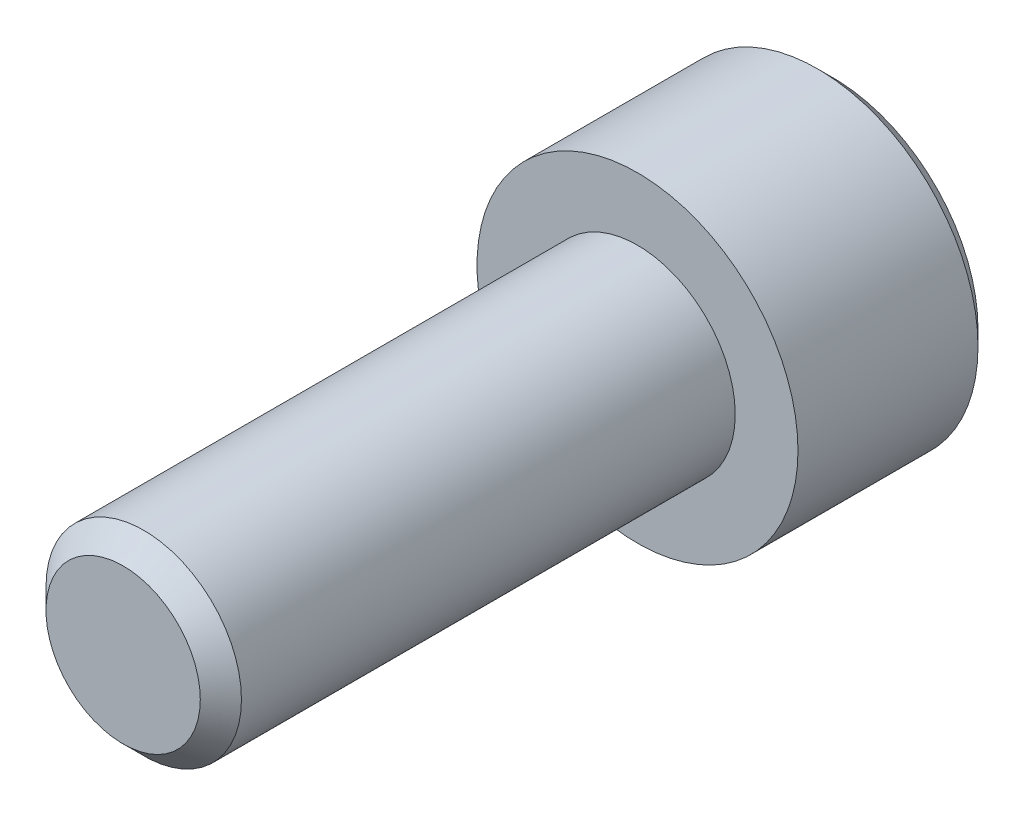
ISO-10303-21;
HEADER;
FILE_DESCRIPTION(('STEP AP214'),'2;1');
FILE_NAME('part.step','',(''),(''),'','','');
FILE_SCHEMA(('AUTOMOTIVE_DESIGN { 1 0 10303 214 1 1 1 1 }'));
ENDSEC;
DATA;
#1=APPLICATION_CONTEXT('core data for automotive mechanical design processes');
#2=APPLICATION_PROTOCOL_DEFINITION('international standard','automotive_design',2000,#1);
#3=PRODUCT_CONTEXT('',#1,'mechanical');
#4=PRODUCT('Part','Part','',(#3));
#5=PRODUCT_RELATED_PRODUCT_CATEGORY('part','',(#4));
#6=PRODUCT_DEFINITION_FORMATION('','',#4);
#7=PRODUCT_DEFINITION_CONTEXT('part definition',#1,'design');
#8=PRODUCT_DEFINITION('design','',#6,#7);
#9=PRODUCT_DEFINITION_SHAPE('','',#8);
#10=(LENGTH_UNIT() NAMED_UNIT(*) SI_UNIT(.MILLI.,.METRE.));
#11=(NAMED_UNIT(*) PLANE_ANGLE_UNIT() SI_UNIT($,.RADIAN.));
#12=(NAMED_UNIT(*) SI_UNIT($,.STERADIAN.) SOLID_ANGLE_UNIT());
#13=UNCERTAINTY_MEASURE_WITH_UNIT(LENGTH_MEASURE(1.E-05),#10,'distance_accuracy_value','');
#14=(GEOMETRIC_REPRESENTATION_CONTEXT(3) GLOBAL_UNCERTAINTY_ASSIGNED_CONTEXT((#13)) GLOBAL_UNIT_ASSIGNED_CONTEXT((#10,
#11,#12)) REPRESENTATION_CONTEXT('',''));
#15=CARTESIAN_POINT('',(0.,0.,0.));
#16=DIRECTION('',(0.,0.,1.));
#17=DIRECTION('',(1.,0.,0.));
#18=AXIS2_PLACEMENT_3D('',#15,#16,#17);
#19=CARTESIAN_POINT('',(0.,0.,12.7));
#20=DIRECTION('',(0.,0.,-1.));
#21=DIRECTION('',(-1.,0.,0.));
#22=AXIS2_PLACEMENT_3D('',#19,#20,#21);
#23=CYLINDRICAL_SURFACE('',#22,2.413);
#24=CARTESIAN_POINT('',(0.,0.,12.192));
#25=DIRECTION('',(0.,0.,1.));
#26=DIRECTION('',(1.,0.,0.));
#27=AXIS2_PLACEMENT_3D('',#24,#25,#26);
#28=CIRCLE('',#27,2.413);
#29=CARTESIAN_POINT('',(2.413,0.,12.192));
#30=VERTEX_POINT('',#29);
#31=EDGE_CURVE('E149',#30,#30,#28,.F.);
#32=ORIENTED_EDGE('',*,*,#31,.T.);
#33=EDGE_LOOP('',(#32));
#34=FACE_BOUND('',#33,.T.);
#35=CARTESIAN_POINT('',(0.,0.,0.));
#36=DIRECTION('',(0.,0.,1.));
#37=DIRECTION('',(1.,0.,0.));
#38=AXIS2_PLACEMENT_3D('',#35,#36,#37);
#39=CIRCLE('',#38,2.413);
#40=CARTESIAN_POINT('',(2.413,0.,0.));
#41=VERTEX_POINT('',#40);
#42=EDGE_CURVE('E143',#41,#41,#39,.T.);
#43=ORIENTED_EDGE('',*,*,#42,.T.);
#44=EDGE_LOOP('',(#43));
#45=FACE_BOUND('',#44,.T.);
#46=ADVANCED_FACE('F33',(#34,#45),#23,.T.);
#47=CARTESIAN_POINT('',(0.,0.,12.7));
#48=DIRECTION('',(0.,0.,1.));
#49=DIRECTION('',(1.,0.,0.));
#50=AXIS2_PLACEMENT_3D('',#47,#48,#49);
#51=PLANE('',#50);
#52=CARTESIAN_POINT('',(0.,0.,12.7));
#53=DIRECTION('',(0.,0.,1.));
#54=DIRECTION('',(1.,0.,0.));
#55=AXIS2_PLACEMENT_3D('',#52,#53,#54);
#56=CIRCLE('',#55,1.905);
#57=CARTESIAN_POINT('',(1.905,0.,12.7));
#58=VERTEX_POINT('',#57);
#59=EDGE_CURVE('E146',#58,#58,#56,.T.);
#60=ORIENTED_EDGE('',*,*,#59,.T.);
#61=EDGE_LOOP('',(#60));
#62=FACE_BOUND('',#61,.T.);
#63=ADVANCED_FACE('F170',(#62),#51,.T.);
#64=CARTESIAN_POINT('',(0.,0.,0.));
#65=DIRECTION('',(0.,0.,1.));
#66=DIRECTION('',(1.,0.,0.));
#67=AXIS2_PLACEMENT_3D('',#64,#65,#66);
#68=PLANE('',#67);
#69=CARTESIAN_POINT('',(0.,0.,0.));
#70=DIRECTION('',(0.,0.,1.));
#71=DIRECTION('',(1.,0.,0.));
#72=AXIS2_PLACEMENT_3D('',#69,#70,#71);
#73=CIRCLE('',#72,3.9624);
#74=CARTESIAN_POINT('',(3.9624,0.,0.));
#75=VERTEX_POINT('',#74);
#76=EDGE_CURVE('E134',#75,#75,#73,.T.);
#77=ORIENTED_EDGE('',*,*,#76,.T.);
#78=EDGE_LOOP('',(#77));
#79=FACE_BOUND('',#78,.T.);
#80=ORIENTED_EDGE('',*,*,#42,.F.);
#81=EDGE_LOOP('',(#80));
#82=FACE_BOUND('',#81,.T.);
#83=ADVANCED_FACE('F175',(#79,#82),#68,.T.);
#84=CARTESIAN_POINT('',(0.,0.,-4.826));
#85=DIRECTION('',(0.,0.,1.));
#86=DIRECTION('',(1.,0.,0.));
#87=AXIS2_PLACEMENT_3D('',#84,#85,#86);
#88=CYLINDRICAL_SURFACE('',#87,3.9624);
#89=CARTESIAN_POINT('',(0.,0.,-4.445));
#90=DIRECTION('',(0.,0.,1.));
#91=DIRECTION('',(1.,0.,0.));
#92=AXIS2_PLACEMENT_3D('',#89,#90,#91);
#93=CIRCLE('',#92,3.9624);
#94=CARTESIAN_POINT('',(3.9624,0.,-4.445));
#95=VERTEX_POINT('',#94);
#96=EDGE_CURVE('E40',#95,#95,#93,.T.);
#97=ORIENTED_EDGE('',*,*,#96,.T.);
#98=EDGE_LOOP('',(#97));
#99=FACE_BOUND('',#98,.T.);
#100=ORIENTED_EDGE('',*,*,#76,.F.);
#101=EDGE_LOOP('',(#100));
#102=FACE_BOUND('',#101,.T.);
#103=ADVANCED_FACE('F154',(#99,#102),#88,.T.);
#104=CARTESIAN_POINT('',(0.,0.,-4.826));
#105=DIRECTION('',(0.,0.,1.));
#106=DIRECTION('',(1.,0.,0.));
#107=AXIS2_PLACEMENT_3D('',#104,#105,#106);
#108=PLANE('',#107);
#109=CARTESIAN_POINT('',(0.,0.,-4.826));
#110=DIRECTION('',(0.,0.,1.));
#111=DIRECTION('',(1.,0.,0.));
#112=AXIS2_PLACEMENT_3D('',#109,#110,#111);
#113=CIRCLE('',#112,3.5814);
#114=CARTESIAN_POINT('',(3.5814,0.,-4.826));
#115=VERTEX_POINT('',#114);
#116=EDGE_CURVE('E11',#115,#115,#113,.F.);
#117=ORIENTED_EDGE('',*,*,#116,.T.);
#118=EDGE_LOOP('',(#117));
#119=FACE_BOUND('',#118,.T.);
#120=DIRECTION('',(0.5,0.866025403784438,0.));
#121=VECTOR('',#120,1.);
#122=CARTESIAN_POINT('',(-2.28769270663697,0.,-4.826));
#123=LINE('',#122,#121);
#124=CARTESIAN_POINT('',(-2.28769270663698,0.,-4.826));
#125=VERTEX_POINT('',#124);
#126=CARTESIAN_POINT('',(-1.14384635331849,1.9812,-4.826));
#127=VERTEX_POINT('',#126);
#128=EDGE_CURVE('E101',#125,#127,#123,.T.);
#129=ORIENTED_EDGE('',*,*,#128,.F.);
#130=DIRECTION('',(-0.5,0.866025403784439,0.));
#131=VECTOR('',#130,1.);
#132=CARTESIAN_POINT('',(-1.14384635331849,-1.9812,-4.826));
#133=LINE('',#132,#131);
#134=CARTESIAN_POINT('',(-1.14384635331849,-1.9812,-4.826));
#135=VERTEX_POINT('',#134);
#136=EDGE_CURVE('E47',#135,#125,#133,.T.);
#137=ORIENTED_EDGE('',*,*,#136,.F.);
#138=DIRECTION('',(-1.,0.,0.));
#139=VECTOR('',#138,1.);
#140=CARTESIAN_POINT('',(1.14384635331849,-1.9812,-4.826));
#141=LINE('',#140,#139);
#142=CARTESIAN_POINT('',(1.14384635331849,-1.9812,-4.826));
#143=VERTEX_POINT('',#142);
#144=EDGE_CURVE('E116',#143,#135,#141,.T.);
#145=ORIENTED_EDGE('',*,*,#144,.F.);
#146=DIRECTION('',(-0.5,-0.866025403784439,0.));
#147=VECTOR('',#146,1.);
#148=CARTESIAN_POINT('',(2.28769270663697,0.,-4.826));
#149=LINE('',#148,#147);
#150=CARTESIAN_POINT('',(2.28769270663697,0.,-4.826));
#151=VERTEX_POINT('',#150);
#152=EDGE_CURVE('E110',#151,#143,#149,.T.);
#153=ORIENTED_EDGE('',*,*,#152,.F.);
#154=DIRECTION('',(0.5,-0.866025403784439,0.));
#155=VECTOR('',#154,1.);
#156=CARTESIAN_POINT('',(1.14384635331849,1.9812,-4.826));
#157=LINE('',#156,#155);
#158=CARTESIAN_POINT('',(1.14384635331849,1.9812,-4.826));
#159=VERTEX_POINT('',#158);
#160=EDGE_CURVE('E108',#159,#151,#157,.T.);
#161=ORIENTED_EDGE('',*,*,#160,.F.);
#162=DIRECTION('',(1.,0.,0.));
#163=VECTOR('',#162,1.);
#164=CARTESIAN_POINT('',(-1.14384635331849,1.9812,-4.826));
#165=LINE('',#164,#163);
#166=EDGE_CURVE('E90',#127,#159,#165,.T.);
#167=ORIENTED_EDGE('',*,*,#166,.F.);
#168=EDGE_LOOP('',(#129,#137,#145,#153,#161,#167));
#169=FACE_BOUND('',#168,.T.);
#170=ADVANCED_FACE('F105',(#119,#169),#108,.F.);
#171=CARTESIAN_POINT('',(-1.14384635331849,-1.9812,-2.54));
#172=DIRECTION('',(-0.866025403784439,-0.5,0.));
#173=DIRECTION('',(0.5,-0.866025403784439,0.));
#174=AXIS2_PLACEMENT_3D('',#171,#172,#173);
#175=PLANE('',#174);
#176=ORIENTED_EDGE('',*,*,#136,.T.);
#177=DIRECTION('',(0.,0.,-1.));
#178=VECTOR('',#177,1.);
#179=CARTESIAN_POINT('',(-2.28769270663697,0.,-2.54));
#180=LINE('',#179,#178);
#181=CARTESIAN_POINT('',(-2.28769270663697,0.,-2.54));
#182=VERTEX_POINT('',#181);
#183=EDGE_CURVE('E98',#182,#125,#180,.T.);
#184=ORIENTED_EDGE('',*,*,#183,.F.);
#185=DIRECTION('',(-0.5,0.866025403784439,0.));
#186=VECTOR('',#185,1.);
#187=CARTESIAN_POINT('',(-1.14384635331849,-1.9812,-2.54));
#188=LINE('',#187,#186);
#189=CARTESIAN_POINT('',(-1.14384635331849,-1.9812,-2.54));
#190=VERTEX_POINT('',#189);
#191=EDGE_CURVE('E118',#190,#182,#188,.T.);
#192=ORIENTED_EDGE('',*,*,#191,.F.);
#193=DIRECTION('',(0.,0.,-1.));
#194=VECTOR('',#193,1.);
#195=CARTESIAN_POINT('',(-1.14384635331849,-1.9812,-2.54));
#196=LINE('',#195,#194);
#197=EDGE_CURVE('E54',#190,#135,#196,.T.);
#198=ORIENTED_EDGE('',*,*,#197,.T.);
#199=EDGE_LOOP('',(#176,#184,#192,#198));
#200=FACE_BOUND('',#199,.T.);
#201=ADVANCED_FACE('F190',(#200),#175,.F.);
#202=CARTESIAN_POINT('',(1.14384635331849,-1.9812,-2.54));
#203=DIRECTION('',(0.,-1.,0.));
#204=DIRECTION('',(0.,0.,-1.));
#205=AXIS2_PLACEMENT_3D('',#202,#203,#204);
#206=PLANE('',#205);
#207=ORIENTED_EDGE('',*,*,#144,.T.);
#208=ORIENTED_EDGE('',*,*,#197,.F.);
#209=DIRECTION('',(-1.,0.,0.));
#210=VECTOR('',#209,1.);
#211=CARTESIAN_POINT('',(1.14384635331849,-1.9812,-2.54));
#212=LINE('',#211,#210);
#213=CARTESIAN_POINT('',(1.14384635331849,-1.9812,-2.54));
#214=VERTEX_POINT('',#213);
#215=EDGE_CURVE('E130',#214,#190,#212,.T.);
#216=ORIENTED_EDGE('',*,*,#215,.F.);
#217=DIRECTION('',(0.,0.,-1.));
#218=VECTOR('',#217,1.);
#219=CARTESIAN_POINT('',(1.14384635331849,-1.9812,-2.54));
#220=LINE('',#219,#218);
#221=EDGE_CURVE('E135',#214,#143,#220,.T.);
#222=ORIENTED_EDGE('',*,*,#221,.T.);
#223=EDGE_LOOP('',(#207,#208,#216,#222));
#224=FACE_BOUND('',#223,.T.);
#225=ADVANCED_FACE('F197',(#224),#206,.F.);
#226=CARTESIAN_POINT('',(2.28769270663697,0.,-2.54));
#227=DIRECTION('',(0.866025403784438,-0.5,0.));
#228=DIRECTION('',(0.5,0.866025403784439,0.));
#229=AXIS2_PLACEMENT_3D('',#226,#227,#228);
#230=PLANE('',#229);
#231=ORIENTED_EDGE('',*,*,#152,.T.);
#232=ORIENTED_EDGE('',*,*,#221,.F.);
#233=DIRECTION('',(-0.5,-0.866025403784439,0.));
#234=VECTOR('',#233,1.);
#235=CARTESIAN_POINT('',(2.28769270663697,0.,-2.54));
#236=LINE('',#235,#234);
#237=CARTESIAN_POINT('',(2.28769270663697,0.,-2.54));
#238=VERTEX_POINT('',#237);
#239=EDGE_CURVE('E127',#238,#214,#236,.T.);
#240=ORIENTED_EDGE('',*,*,#239,.F.);
#241=DIRECTION('',(0.,0.,-1.));
#242=VECTOR('',#241,1.);
#243=CARTESIAN_POINT('',(2.28769270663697,0.,-2.54));
#244=LINE('',#243,#242);
#245=EDGE_CURVE('E137',#238,#151,#244,.T.);
#246=ORIENTED_EDGE('',*,*,#245,.T.);
#247=EDGE_LOOP('',(#231,#232,#240,#246));
#248=FACE_BOUND('',#247,.T.);
#249=ADVANCED_FACE('F201',(#248),#230,.F.);
#250=CARTESIAN_POINT('',(1.14384635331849,1.9812,-2.54));
#251=DIRECTION('',(0.866025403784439,0.5,0.));
#252=DIRECTION('',(-0.5,0.866025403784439,0.));
#253=AXIS2_PLACEMENT_3D('',#250,#251,#252);
#254=PLANE('',#253);
#255=ORIENTED_EDGE('',*,*,#160,.T.);
#256=ORIENTED_EDGE('',*,*,#245,.F.);
#257=DIRECTION('',(0.5,-0.866025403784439,0.));
#258=VECTOR('',#257,1.);
#259=CARTESIAN_POINT('',(1.14384635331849,1.9812,-2.54));
#260=LINE('',#259,#258);
#261=CARTESIAN_POINT('',(1.14384635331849,1.9812,-2.54));
#262=VERTEX_POINT('',#261);
#263=EDGE_CURVE('E124',#262,#238,#260,.T.);
#264=ORIENTED_EDGE('',*,*,#263,.F.);
#265=DIRECTION('',(0.,0.,-1.));
#266=VECTOR('',#265,1.);
#267=CARTESIAN_POINT('',(1.14384635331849,1.9812,-2.54));
#268=LINE('',#267,#266);
#269=EDGE_CURVE('E97',#262,#159,#268,.T.);
#270=ORIENTED_EDGE('',*,*,#269,.T.);
#271=EDGE_LOOP('',(#255,#256,#264,#270));
#272=FACE_BOUND('',#271,.T.);
#273=ADVANCED_FACE('F206',(#272),#254,.F.);
#274=CARTESIAN_POINT('',(-1.14384635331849,1.9812,-2.54));
#275=DIRECTION('',(0.,1.,0.));
#276=DIRECTION('',(-1.,0.,0.));
#277=AXIS2_PLACEMENT_3D('',#274,#275,#276);
#278=PLANE('',#277);
#279=ORIENTED_EDGE('',*,*,#166,.T.);
#280=ORIENTED_EDGE('',*,*,#269,.F.);
#281=DIRECTION('',(1.,0.,0.));
#282=VECTOR('',#281,1.);
#283=CARTESIAN_POINT('',(-1.14384635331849,1.9812,-2.54));
#284=LINE('',#283,#282);
#285=CARTESIAN_POINT('',(-1.14384635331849,1.9812,-2.54));
#286=VERTEX_POINT('',#285);
#287=EDGE_CURVE('E93',#286,#262,#284,.T.);
#288=ORIENTED_EDGE('',*,*,#287,.F.);
#289=DIRECTION('',(0.,0.,-1.));
#290=VECTOR('',#289,1.);
#291=CARTESIAN_POINT('',(-1.14384635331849,1.9812,-2.54));
#292=LINE('',#291,#290);
#293=EDGE_CURVE('E86',#286,#127,#292,.T.);
#294=ORIENTED_EDGE('',*,*,#293,.T.);
#295=EDGE_LOOP('',(#279,#280,#288,#294));
#296=FACE_BOUND('',#295,.T.);
#297=ADVANCED_FACE('F88',(#296),#278,.F.);
#298=CARTESIAN_POINT('',(-2.28769270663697,0.,-2.54));
#299=DIRECTION('',(-0.866025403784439,0.5,0.));
#300=DIRECTION('',(-0.5,-0.866025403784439,0.));
#301=AXIS2_PLACEMENT_3D('',#298,#299,#300);
#302=PLANE('',#301);
#303=ORIENTED_EDGE('',*,*,#128,.T.);
#304=ORIENTED_EDGE('',*,*,#293,.F.);
#305=DIRECTION('',(0.5,0.866025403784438,0.));
#306=VECTOR('',#305,1.);
#307=CARTESIAN_POINT('',(-2.28769270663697,0.,-2.54));
#308=LINE('',#307,#306);
#309=EDGE_CURVE('E121',#182,#286,#308,.T.);
#310=ORIENTED_EDGE('',*,*,#309,.F.);
#311=ORIENTED_EDGE('',*,*,#183,.T.);
#312=EDGE_LOOP('',(#303,#304,#310,#311));
#313=FACE_BOUND('',#312,.T.);
#314=ADVANCED_FACE('F102',(#313),#302,.F.);
#315=CARTESIAN_POINT('',(-1.14384635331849,-1.9812,-2.54));
#316=DIRECTION('',(0.,0.,1.));
#317=DIRECTION('',(1.,0.,0.));
#318=AXIS2_PLACEMENT_3D('',#315,#316,#317);
#319=PLANE('',#318);
#320=ORIENTED_EDGE('',*,*,#191,.T.);
#321=ORIENTED_EDGE('',*,*,#309,.T.);
#322=ORIENTED_EDGE('',*,*,#287,.T.);
#323=ORIENTED_EDGE('',*,*,#263,.T.);
#324=ORIENTED_EDGE('',*,*,#239,.T.);
#325=ORIENTED_EDGE('',*,*,#215,.T.);
#326=EDGE_LOOP('',(#320,#321,#322,#323,#324,#325));
#327=FACE_BOUND('',#326,.T.);
#328=ADVANCED_FACE('F165',(#327),#319,.F.);
#329=CARTESIAN_POINT('',(0.,0.,12.7));
#330=DIRECTION('',(0.,0.,-1.));
#331=DIRECTION('',(-1.,0.,0.));
#332=AXIS2_PLACEMENT_3D('',#329,#330,#331);
#333=CONICAL_SURFACE('',#332,1.905,0.785398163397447);
#334=ORIENTED_EDGE('',*,*,#31,.F.);
#335=EDGE_LOOP('',(#334));
#336=FACE_BOUND('',#335,.T.);
#337=ORIENTED_EDGE('',*,*,#59,.F.);
#338=EDGE_LOOP('',(#337));
#339=FACE_BOUND('',#338,.T.);
#340=ADVANCED_FACE('F159',(#336,#339),#333,.T.);
#341=CARTESIAN_POINT('',(0.,0.,-4.445));
#342=DIRECTION('',(0.,0.,1.));
#343=DIRECTION('',(1.,0.,0.));
#344=AXIS2_PLACEMENT_3D('',#341,#342,#343);
#345=CONICAL_SURFACE('',#344,3.9624,0.785398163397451);
#346=ORIENTED_EDGE('',*,*,#116,.F.);
#347=EDGE_LOOP('',(#346));
#348=FACE_BOUND('',#347,.T.);
#349=ORIENTED_EDGE('',*,*,#96,.F.);
#350=EDGE_LOOP('',(#349));
#351=FACE_BOUND('',#350,.T.);
#352=ADVANCED_FACE('F157',(#348,#351),#345,.T.);
#353=CLOSED_SHELL('',(#46,#63,#83,#103,#170,#201,#225,#249,#273,#297,#314,#328,#340,#352));
#354=MANIFOLD_SOLID_BREP('B2',#353);
#355=ADVANCED_BREP_SHAPE_REPRESENTATION('',(#18,#354),#14);
#356=SHAPE_DEFINITION_REPRESENTATION(#9,#355);
ENDSEC;
END-ISO-10303-21;
